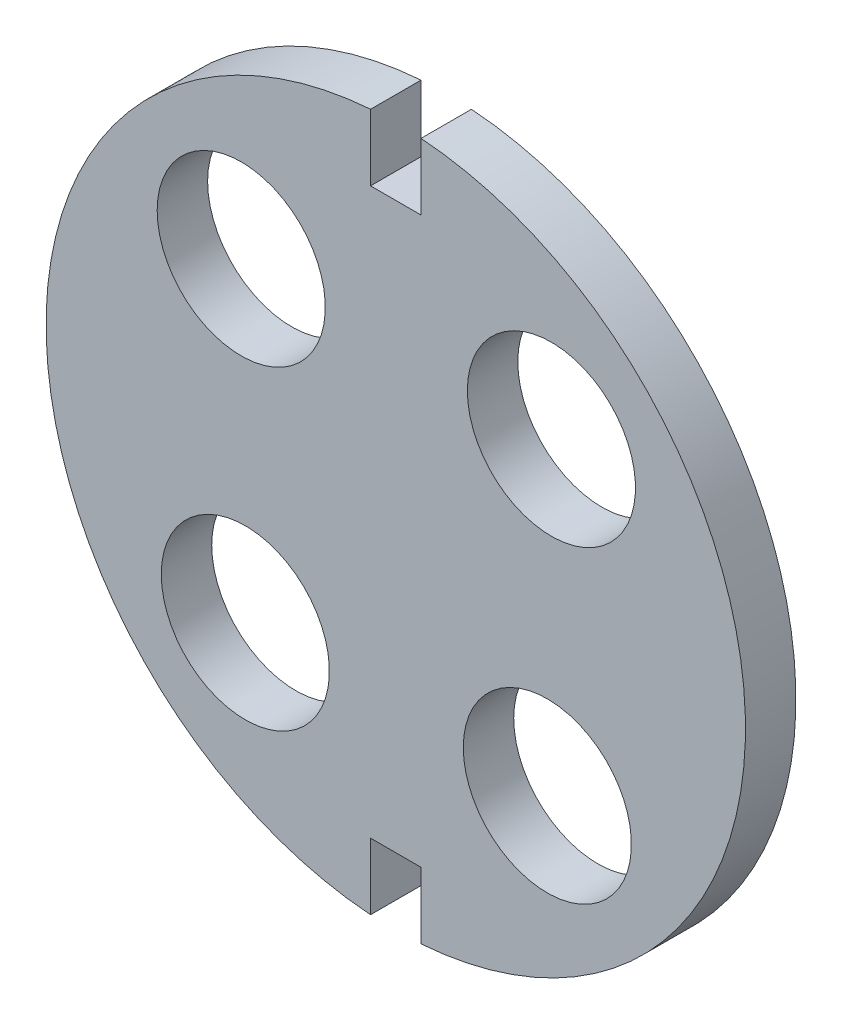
ISO-10303-21;
HEADER;
FILE_DESCRIPTION(('STEP AP214'),'2;1');
FILE_NAME('part.step','',(''),(''),'','','');
FILE_SCHEMA(('AUTOMOTIVE_DESIGN { 1 0 10303 214 1 1 1 1 }'));
ENDSEC;
DATA;
#1=APPLICATION_CONTEXT('core data for automotive mechanical design processes');
#2=APPLICATION_PROTOCOL_DEFINITION('international standard','automotive_design',2000,#1);
#3=PRODUCT_CONTEXT('',#1,'mechanical');
#4=PRODUCT('Part','Part','',(#3));
#5=PRODUCT_RELATED_PRODUCT_CATEGORY('part','',(#4));
#6=PRODUCT_DEFINITION_FORMATION('','',#4);
#7=PRODUCT_DEFINITION_CONTEXT('part definition',#1,'design');
#8=PRODUCT_DEFINITION('design','',#6,#7);
#9=PRODUCT_DEFINITION_SHAPE('','',#8);
#10=(LENGTH_UNIT() NAMED_UNIT(*) SI_UNIT(.MILLI.,.METRE.));
#11=(NAMED_UNIT(*) PLANE_ANGLE_UNIT() SI_UNIT($,.RADIAN.));
#12=(NAMED_UNIT(*) SI_UNIT($,.STERADIAN.) SOLID_ANGLE_UNIT());
#13=UNCERTAINTY_MEASURE_WITH_UNIT(LENGTH_MEASURE(1.E-05),#10,'distance_accuracy_value','');
#14=(GEOMETRIC_REPRESENTATION_CONTEXT(3) GLOBAL_UNCERTAINTY_ASSIGNED_CONTEXT((#13)) GLOBAL_UNIT_ASSIGNED_CONTEXT((#10,
#11,#12)) REPRESENTATION_CONTEXT('',''));
#15=CARTESIAN_POINT('',(0.,0.,0.));
#16=DIRECTION('',(0.,0.,1.));
#17=DIRECTION('',(1.,0.,0.));
#18=AXIS2_PLACEMENT_3D('',#15,#16,#17);
#19=CARTESIAN_POINT('',(0.,0.,3.81));
#20=DIRECTION('',(0.,0.,1.));
#21=DIRECTION('',(1.,0.,0.));
#22=AXIS2_PLACEMENT_3D('',#19,#20,#21);
#23=PLANE('',#22);
#24=CARTESIAN_POINT('',(11.4489030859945,-11.8954915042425,3.81));
#25=DIRECTION('',(0.,0.,1.));
#26=DIRECTION('',(1.,0.,0.));
#27=AXIS2_PLACEMENT_3D('',#24,#25,#26);
#28=CIRCLE('',#27,6.35);
#29=CARTESIAN_POINT('',(5.09890308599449,-11.8954915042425,3.81));
#30=VERTEX_POINT('',#29);
#31=EDGE_CURVE('E156',#30,#30,#28,.T.);
#32=ORIENTED_EDGE('',*,*,#31,.F.);
#33=EDGE_LOOP('',(#32));
#34=FACE_BOUND('',#33,.T.);
#35=CARTESIAN_POINT('',(-11.6743329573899,11.6743329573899,3.81));
#36=DIRECTION('',(0.,0.,1.));
#37=DIRECTION('',(1.,0.,0.));
#38=AXIS2_PLACEMENT_3D('',#35,#36,#37);
#39=CIRCLE('',#38,6.35);
#40=CARTESIAN_POINT('',(-18.0243329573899,11.6743329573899,3.81));
#41=VERTEX_POINT('',#40);
#42=EDGE_CURVE('E168',#41,#41,#39,.T.);
#43=ORIENTED_EDGE('',*,*,#42,.F.);
#44=EDGE_LOOP('',(#43));
#45=FACE_BOUND('',#44,.T.);
#46=CARTESIAN_POINT('',(11.7568886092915,11.5911893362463,3.81));
#47=DIRECTION('',(0.,0.,1.));
#48=DIRECTION('',(1.,0.,0.));
#49=AXIS2_PLACEMENT_3D('',#46,#47,#48);
#50=CIRCLE('',#49,6.35);
#51=CARTESIAN_POINT('',(5.40688860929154,11.5911893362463,3.81));
#52=VERTEX_POINT('',#51);
#53=EDGE_CURVE('E162',#52,#52,#50,.T.);
#54=ORIENTED_EDGE('',*,*,#53,.F.);
#55=EDGE_LOOP('',(#54));
#56=FACE_BOUND('',#55,.T.);
#57=CARTESIAN_POINT('',(-11.3642808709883,-11.9763608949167,3.81));
#58=DIRECTION('',(0.,0.,1.));
#59=DIRECTION('',(1.,0.,0.));
#60=AXIS2_PLACEMENT_3D('',#57,#58,#59);
#61=CIRCLE('',#60,6.35);
#62=CARTESIAN_POINT('',(-17.7142808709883,-11.9763608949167,3.81));
#63=VERTEX_POINT('',#62);
#64=EDGE_CURVE('E150',#63,#63,#61,.T.);
#65=ORIENTED_EDGE('',*,*,#64,.F.);
#66=EDGE_LOOP('',(#65));
#67=FACE_BOUND('',#66,.T.);
#68=DIRECTION('',(-1.,0.,0.));
#69=VECTOR('',#68,1.);
#70=CARTESIAN_POINT('',(1.905,-21.336,3.81));
#71=LINE('',#70,#69);
#72=CARTESIAN_POINT('',(1.905,-21.336,3.81));
#73=VERTEX_POINT('',#72);
#74=CARTESIAN_POINT('',(-1.905,-21.336,3.81));
#75=VERTEX_POINT('',#74);
#76=EDGE_CURVE('E125',#73,#75,#71,.T.);
#77=ORIENTED_EDGE('',*,*,#76,.F.);
#78=DIRECTION('',(0.,1.,0.));
#79=VECTOR('',#78,1.);
#80=CARTESIAN_POINT('',(1.905,-27.9234461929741,3.81));
#81=LINE('',#80,#79);
#82=CARTESIAN_POINT('',(1.905,-26.3472205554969,3.81));
#83=VERTEX_POINT('',#82);
#84=EDGE_CURVE('E114',#83,#73,#81,.T.);
#85=ORIENTED_EDGE('',*,*,#84,.F.);
#86=CARTESIAN_POINT('',(0.,0.,3.81));
#87=DIRECTION('',(0.,0.,1.));
#88=DIRECTION('',(1.,0.,0.));
#89=AXIS2_PLACEMENT_3D('',#86,#87,#88);
#90=CIRCLE('',#89,26.416);
#91=CARTESIAN_POINT('',(1.905,26.3472205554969,3.81));
#92=VERTEX_POINT('',#91);
#93=EDGE_CURVE('E54',#83,#92,#90,.T.);
#94=ORIENTED_EDGE('',*,*,#93,.T.);
#95=DIRECTION('',(0.,1.,0.));
#96=VECTOR('',#95,1.);
#97=CARTESIAN_POINT('',(1.905,27.419564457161,3.81));
#98=LINE('',#97,#96);
#99=CARTESIAN_POINT('',(1.905,21.336,3.81));
#100=VERTEX_POINT('',#99);
#101=EDGE_CURVE('E140',#100,#92,#98,.T.);
#102=ORIENTED_EDGE('',*,*,#101,.F.);
#103=DIRECTION('',(1.,0.,0.));
#104=VECTOR('',#103,1.);
#105=CARTESIAN_POINT('',(-1.905,21.336,3.81));
#106=LINE('',#105,#104);
#107=CARTESIAN_POINT('',(-1.905,21.336,3.81));
#108=VERTEX_POINT('',#107);
#109=EDGE_CURVE('E138',#108,#100,#106,.T.);
#110=ORIENTED_EDGE('',*,*,#109,.F.);
#111=DIRECTION('',(0.,-1.,0.));
#112=VECTOR('',#111,1.);
#113=CARTESIAN_POINT('',(-1.905,27.419564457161,3.81));
#114=LINE('',#113,#112);
#115=CARTESIAN_POINT('',(-1.905,26.3472205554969,3.81));
#116=VERTEX_POINT('',#115);
#117=EDGE_CURVE('E136',#116,#108,#114,.T.);
#118=ORIENTED_EDGE('',*,*,#117,.F.);
#119=CARTESIAN_POINT('',(-1.905,-26.3472205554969,3.81));
#120=VERTEX_POINT('',#119);
#121=EDGE_CURVE('E174',#116,#120,#90,.T.);
#122=ORIENTED_EDGE('',*,*,#121,.T.);
#123=DIRECTION('',(0.,-1.,0.));
#124=VECTOR('',#123,1.);
#125=CARTESIAN_POINT('',(-1.905,-27.9234461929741,3.81));
#126=LINE('',#125,#124);
#127=EDGE_CURVE('E46',#75,#120,#126,.T.);
#128=ORIENTED_EDGE('',*,*,#127,.F.);
#129=EDGE_LOOP('',(#77,#85,#94,#102,#110,#118,#122,#128));
#130=FACE_BOUND('',#129,.T.);
#131=ADVANCED_FACE('F31',(#34,#45,#56,#67,#130),#23,.T.);
#132=CARTESIAN_POINT('',(0.,0.,0.));
#133=DIRECTION('',(0.,0.,1.));
#134=DIRECTION('',(1.,0.,0.));
#135=AXIS2_PLACEMENT_3D('',#132,#133,#134);
#136=PLANE('',#135);
#137=CARTESIAN_POINT('',(11.4489030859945,-11.8954915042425,0.));
#138=DIRECTION('',(0.,0.,1.));
#139=DIRECTION('',(1.,0.,0.));
#140=AXIS2_PLACEMENT_3D('',#137,#138,#139);
#141=CIRCLE('',#140,6.35);
#142=CARTESIAN_POINT('',(5.09890308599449,-11.8954915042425,0.));
#143=VERTEX_POINT('',#142);
#144=EDGE_CURVE('E153',#143,#143,#141,.T.);
#145=ORIENTED_EDGE('',*,*,#144,.T.);
#146=EDGE_LOOP('',(#145));
#147=FACE_BOUND('',#146,.T.);
#148=CARTESIAN_POINT('',(-11.6743329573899,11.6743329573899,0.));
#149=DIRECTION('',(0.,0.,1.));
#150=DIRECTION('',(1.,0.,0.));
#151=AXIS2_PLACEMENT_3D('',#148,#149,#150);
#152=CIRCLE('',#151,6.35);
#153=CARTESIAN_POINT('',(-18.0243329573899,11.6743329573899,0.));
#154=VERTEX_POINT('',#153);
#155=EDGE_CURVE('E165',#154,#154,#152,.T.);
#156=ORIENTED_EDGE('',*,*,#155,.T.);
#157=EDGE_LOOP('',(#156));
#158=FACE_BOUND('',#157,.T.);
#159=CARTESIAN_POINT('',(11.7568886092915,11.5911893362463,0.));
#160=DIRECTION('',(0.,0.,1.));
#161=DIRECTION('',(1.,0.,0.));
#162=AXIS2_PLACEMENT_3D('',#159,#160,#161);
#163=CIRCLE('',#162,6.35);
#164=CARTESIAN_POINT('',(5.40688860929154,11.5911893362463,0.));
#165=VERTEX_POINT('',#164);
#166=EDGE_CURVE('E159',#165,#165,#163,.T.);
#167=ORIENTED_EDGE('',*,*,#166,.T.);
#168=EDGE_LOOP('',(#167));
#169=FACE_BOUND('',#168,.T.);
#170=CARTESIAN_POINT('',(-11.3642808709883,-11.9763608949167,0.));
#171=DIRECTION('',(0.,0.,1.));
#172=DIRECTION('',(1.,0.,0.));
#173=AXIS2_PLACEMENT_3D('',#170,#171,#172);
#174=CIRCLE('',#173,6.35);
#175=CARTESIAN_POINT('',(-17.7142808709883,-11.9763608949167,0.));
#176=VERTEX_POINT('',#175);
#177=EDGE_CURVE('E147',#176,#176,#174,.T.);
#178=ORIENTED_EDGE('',*,*,#177,.T.);
#179=EDGE_LOOP('',(#178));
#180=FACE_BOUND('',#179,.T.);
#181=DIRECTION('',(0.,1.,0.));
#182=VECTOR('',#181,1.);
#183=CARTESIAN_POINT('',(1.905,-27.9234461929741,0.));
#184=LINE('',#183,#182);
#185=CARTESIAN_POINT('',(1.905,-26.3472205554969,0.));
#186=VERTEX_POINT('',#185);
#187=CARTESIAN_POINT('',(1.905,-21.336,0.));
#188=VERTEX_POINT('',#187);
#189=EDGE_CURVE('E109',#186,#188,#184,.T.);
#190=ORIENTED_EDGE('',*,*,#189,.T.);
#191=DIRECTION('',(-1.,0.,0.));
#192=VECTOR('',#191,1.);
#193=CARTESIAN_POINT('',(1.905,-21.336,0.));
#194=LINE('',#193,#192);
#195=CARTESIAN_POINT('',(-1.905,-21.336,0.));
#196=VERTEX_POINT('',#195);
#197=EDGE_CURVE('E98',#188,#196,#194,.T.);
#198=ORIENTED_EDGE('',*,*,#197,.T.);
#199=DIRECTION('',(0.,-1.,0.));
#200=VECTOR('',#199,1.);
#201=CARTESIAN_POINT('',(-1.905,-27.9234461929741,0.));
#202=LINE('',#201,#200);
#203=CARTESIAN_POINT('',(-1.905,-26.3472205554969,0.));
#204=VERTEX_POINT('',#203);
#205=EDGE_CURVE('E108',#196,#204,#202,.T.);
#206=ORIENTED_EDGE('',*,*,#205,.T.);
#207=CARTESIAN_POINT('',(0.,0.,0.));
#208=DIRECTION('',(0.,0.,1.));
#209=DIRECTION('',(1.,0.,0.));
#210=AXIS2_PLACEMENT_3D('',#207,#208,#209);
#211=CIRCLE('',#210,26.416);
#212=CARTESIAN_POINT('',(-1.905,26.3472205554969,0.));
#213=VERTEX_POINT('',#212);
#214=EDGE_CURVE('E171',#213,#204,#211,.T.);
#215=ORIENTED_EDGE('',*,*,#214,.F.);
#216=DIRECTION('',(0.,-1.,0.));
#217=VECTOR('',#216,1.);
#218=CARTESIAN_POINT('',(-1.905,27.419564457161,0.));
#219=LINE('',#218,#217);
#220=CARTESIAN_POINT('',(-1.905,21.336,0.));
#221=VERTEX_POINT('',#220);
#222=EDGE_CURVE('E115',#213,#221,#219,.T.);
#223=ORIENTED_EDGE('',*,*,#222,.T.);
#224=DIRECTION('',(1.,0.,0.));
#225=VECTOR('',#224,1.);
#226=CARTESIAN_POINT('',(-1.905,21.336,0.));
#227=LINE('',#226,#225);
#228=CARTESIAN_POINT('',(1.905,21.336,0.));
#229=VERTEX_POINT('',#228);
#230=EDGE_CURVE('E131',#221,#229,#227,.T.);
#231=ORIENTED_EDGE('',*,*,#230,.T.);
#232=DIRECTION('',(0.,1.,0.));
#233=VECTOR('',#232,1.);
#234=CARTESIAN_POINT('',(1.905,27.419564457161,0.));
#235=LINE('',#234,#233);
#236=CARTESIAN_POINT('',(1.905,26.3472205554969,0.));
#237=VERTEX_POINT('',#236);
#238=EDGE_CURVE('E134',#229,#237,#235,.T.);
#239=ORIENTED_EDGE('',*,*,#238,.T.);
#240=EDGE_CURVE('E120',#186,#237,#211,.T.);
#241=ORIENTED_EDGE('',*,*,#240,.F.);
#242=EDGE_LOOP('',(#190,#198,#206,#215,#223,#231,#239,#241));
#243=FACE_BOUND('',#242,.T.);
#244=ADVANCED_FACE('F118',(#147,#158,#169,#180,#243),#136,.F.);
#245=CARTESIAN_POINT('',(0.,0.,3.81));
#246=DIRECTION('',(0.,0.,-1.));
#247=DIRECTION('',(-1.,0.,0.));
#248=AXIS2_PLACEMENT_3D('',#245,#246,#247);
#249=CYLINDRICAL_SURFACE('',#248,26.416);
#250=DIRECTION('',(0.,0.,-1.));
#251=VECTOR('',#250,1.);
#252=CARTESIAN_POINT('',(1.905,-26.3472205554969,3.81));
#253=LINE('',#252,#251);
#254=EDGE_CURVE('E11',#186,#83,#253,.F.);
#255=ORIENTED_EDGE('',*,*,#254,.F.);
#256=ORIENTED_EDGE('',*,*,#240,.T.);
#257=DIRECTION('',(0.,0.,-1.));
#258=VECTOR('',#257,1.);
#259=CARTESIAN_POINT('',(1.905,26.3472205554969,3.81));
#260=LINE('',#259,#258);
#261=EDGE_CURVE('E177',#92,#237,#260,.T.);
#262=ORIENTED_EDGE('',*,*,#261,.F.);
#263=ORIENTED_EDGE('',*,*,#93,.F.);
#264=EDGE_LOOP('',(#255,#256,#262,#263));
#265=FACE_BOUND('',#264,.T.);
#266=ADVANCED_FACE('F33',(#265),#249,.T.);
#267=DIRECTION('',(0.,0.,-1.));
#268=VECTOR('',#267,1.);
#269=CARTESIAN_POINT('',(-1.905,-26.3472205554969,3.81));
#270=LINE('',#269,#268);
#271=EDGE_CURVE('E39',#120,#204,#270,.T.);
#272=ORIENTED_EDGE('',*,*,#271,.F.);
#273=ORIENTED_EDGE('',*,*,#121,.F.);
#274=DIRECTION('',(0.,0.,-1.));
#275=VECTOR('',#274,1.);
#276=CARTESIAN_POINT('',(-1.905,26.3472205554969,3.81));
#277=LINE('',#276,#275);
#278=EDGE_CURVE('E180',#213,#116,#277,.F.);
#279=ORIENTED_EDGE('',*,*,#278,.F.);
#280=ORIENTED_EDGE('',*,*,#214,.T.);
#281=EDGE_LOOP('',(#272,#273,#279,#280));
#282=FACE_BOUND('',#281,.T.);
#283=ADVANCED_FACE('F186',(#282),#249,.T.);
#284=CARTESIAN_POINT('',(-11.6743329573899,11.6743329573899,3.81));
#285=DIRECTION('',(0.,0.,-1.));
#286=DIRECTION('',(-1.,0.,0.));
#287=AXIS2_PLACEMENT_3D('',#284,#285,#286);
#288=CYLINDRICAL_SURFACE('',#287,6.35);
#289=CARTESIAN_POINT('',(-18.0243329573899,11.6743329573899,3.81));
#290=CARTESIAN_POINT('',(-18.0243329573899,11.6743329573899,3.7703125));
#291=CARTESIAN_POINT('',(-18.0243329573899,11.6743329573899,3.730625));
#292=CARTESIAN_POINT('',(-18.0243329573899,11.6743329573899,3.65125));
#293=CARTESIAN_POINT('',(-18.0243329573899,11.6743329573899,3.6115625));
#294=CARTESIAN_POINT('',(-18.0243329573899,11.6743329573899,3.5321875));
#295=CARTESIAN_POINT('',(-18.0243329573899,11.6743329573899,3.4925));
#296=CARTESIAN_POINT('',(-18.0243329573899,11.6743329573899,3.413125));
#297=CARTESIAN_POINT('',(-18.0243329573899,11.6743329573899,3.3734375));
#298=CARTESIAN_POINT('',(-18.0243329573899,11.6743329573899,3.2940625));
#299=CARTESIAN_POINT('',(-18.0243329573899,11.6743329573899,3.254375));
#300=CARTESIAN_POINT('',(-18.0243329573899,11.6743329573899,3.175));
#301=CARTESIAN_POINT('',(-18.0243329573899,11.6743329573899,3.1353125));
#302=CARTESIAN_POINT('',(-18.0243329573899,11.6743329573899,3.0559375));
#303=CARTESIAN_POINT('',(-18.0243329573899,11.6743329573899,3.01625));
#304=CARTESIAN_POINT('',(-18.0243329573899,11.6743329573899,2.936875));
#305=CARTESIAN_POINT('',(-18.0243329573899,11.6743329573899,2.8971875));
#306=CARTESIAN_POINT('',(-18.0243329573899,11.6743329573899,2.8178125));
#307=CARTESIAN_POINT('',(-18.0243329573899,11.6743329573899,2.778125));
#308=CARTESIAN_POINT('',(-18.0243329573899,11.6743329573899,2.69875));
#309=CARTESIAN_POINT('',(-18.0243329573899,11.6743329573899,2.6590625));
#310=CARTESIAN_POINT('',(-18.0243329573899,11.6743329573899,2.5796875));
#311=CARTESIAN_POINT('',(-18.0243329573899,11.6743329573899,2.54));
#312=CARTESIAN_POINT('',(-18.0243329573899,11.6743329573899,2.460625));
#313=CARTESIAN_POINT('',(-18.0243329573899,11.6743329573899,2.4209375));
#314=CARTESIAN_POINT('',(-18.0243329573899,11.6743329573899,2.3415625));
#315=CARTESIAN_POINT('',(-18.0243329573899,11.6743329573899,2.301875));
#316=CARTESIAN_POINT('',(-18.0243329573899,11.6743329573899,2.2225));
#317=CARTESIAN_POINT('',(-18.0243329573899,11.6743329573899,2.1828125));
#318=CARTESIAN_POINT('',(-18.0243329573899,11.6743329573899,2.1034375));
#319=CARTESIAN_POINT('',(-18.0243329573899,11.6743329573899,2.06375));
#320=CARTESIAN_POINT('',(-18.0243329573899,11.6743329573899,1.984375));
#321=CARTESIAN_POINT('',(-18.0243329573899,11.6743329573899,1.9446875));
#322=CARTESIAN_POINT('',(-18.0243329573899,11.6743329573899,1.8653125));
#323=CARTESIAN_POINT('',(-18.0243329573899,11.6743329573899,1.825625));
#324=CARTESIAN_POINT('',(-18.0243329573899,11.6743329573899,1.74625));
#325=CARTESIAN_POINT('',(-18.0243329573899,11.6743329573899,1.7065625));
#326=CARTESIAN_POINT('',(-18.0243329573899,11.6743329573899,1.6271875));
#327=CARTESIAN_POINT('',(-18.0243329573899,11.6743329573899,1.5875));
#328=CARTESIAN_POINT('',(-18.0243329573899,11.6743329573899,1.508125));
#329=CARTESIAN_POINT('',(-18.0243329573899,11.6743329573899,1.4684375));
#330=CARTESIAN_POINT('',(-18.0243329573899,11.6743329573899,1.3890625));
#331=CARTESIAN_POINT('',(-18.0243329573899,11.6743329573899,1.349375));
#332=CARTESIAN_POINT('',(-18.0243329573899,11.6743329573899,1.27));
#333=CARTESIAN_POINT('',(-18.0243329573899,11.6743329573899,1.2303125));
#334=CARTESIAN_POINT('',(-18.0243329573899,11.6743329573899,1.1509375));
#335=CARTESIAN_POINT('',(-18.0243329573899,11.6743329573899,1.11125));
#336=CARTESIAN_POINT('',(-18.0243329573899,11.6743329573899,1.031875));
#337=CARTESIAN_POINT('',(-18.0243329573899,11.6743329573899,0.9921875));
#338=CARTESIAN_POINT('',(-18.0243329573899,11.6743329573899,0.9128125));
#339=CARTESIAN_POINT('',(-18.0243329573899,11.6743329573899,0.873125));
#340=CARTESIAN_POINT('',(-18.0243329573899,11.6743329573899,0.79375));
#341=CARTESIAN_POINT('',(-18.0243329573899,11.6743329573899,0.7540625));
#342=CARTESIAN_POINT('',(-18.0243329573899,11.6743329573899,0.6746875));
#343=CARTESIAN_POINT('',(-18.0243329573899,11.6743329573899,0.635));
#344=CARTESIAN_POINT('',(-18.0243329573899,11.6743329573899,0.555625));
#345=CARTESIAN_POINT('',(-18.0243329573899,11.6743329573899,0.5159375));
#346=CARTESIAN_POINT('',(-18.0243329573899,11.6743329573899,0.4365625));
#347=CARTESIAN_POINT('',(-18.0243329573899,11.6743329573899,0.396875));
#348=CARTESIAN_POINT('',(-18.0243329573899,11.6743329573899,0.3175));
#349=CARTESIAN_POINT('',(-18.0243329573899,11.6743329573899,0.2778125));
#350=CARTESIAN_POINT('',(-18.0243329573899,11.6743329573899,0.1984375));
#351=CARTESIAN_POINT('',(-18.0243329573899,11.6743329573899,0.15875));
#352=CARTESIAN_POINT('',(-18.0243329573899,11.6743329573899,0.0793749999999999));
#353=CARTESIAN_POINT('',(-18.0243329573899,11.6743329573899,0.0396874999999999));
#354=CARTESIAN_POINT('',(-18.0243329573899,11.6743329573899,0.));
#355=B_SPLINE_CURVE_WITH_KNOTS('',3,(#289,#290,#291,#292,#293,#294,#295,#296,#297,#298,#299,
#300,#301,#302,#303,#304,#305,#306,#307,#308,#309,#310,#311,#312,#313,#314,#315,#316,#317,#318,
#319,#320,#321,#322,#323,#324,#325,#326,#327,#328,#329,#330,#331,#332,#333,#334,#335,#336,#337,
#338,#339,#340,#341,#342,#343,#344,#345,#346,#347,#348,#349,#350,#351,#352,#353,#354),
.UNSPECIFIED.,.F.,.F.,(4,2,2,2,2,2,2,2,2,2,2,2,2,2,2,2,2,2,2,2,2,2,2,2,2,2,2,2,2,2,2,2,4),(0.,
0.1190625,0.238125,0.3571875,0.47625,0.5953125,0.714375,0.8334375,0.9525,1.0715625,1.190625,
1.3096875,1.42875,1.5478125,1.666875,1.7859375,1.905,2.0240625,2.143125,2.2621875,2.38125,
2.5003125,2.619375,2.7384375,2.8575,2.9765625,3.095625,3.2146875,3.33375,3.4528125,3.571875,
3.6909375,3.81),.UNSPECIFIED.);
#356=EDGE_CURVE('BSEAM205',#41,#154,#355,.T.);
#357=ORIENTED_EDGE('',*,*,#42,.T.);
#358=ORIENTED_EDGE('',*,*,#155,.F.);
#359=ORIENTED_EDGE('',*,*,#356,.T.);
#360=ORIENTED_EDGE('',*,*,#356,.F.);
#361=EDGE_LOOP('',(#357,#359,#358,#360));
#362=FACE_BOUND('',#361,.T.);
#363=ADVANCED_FACE('F205',(#362),#288,.F.);
#364=CARTESIAN_POINT('',(11.7568886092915,11.5911893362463,3.81));
#365=DIRECTION('',(0.,0.,-1.));
#366=DIRECTION('',(-1.,0.,0.));
#367=AXIS2_PLACEMENT_3D('',#364,#365,#366);
#368=CYLINDRICAL_SURFACE('',#367,6.35);
#369=CARTESIAN_POINT('',(5.40688860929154,11.5911893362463,3.81));
#370=CARTESIAN_POINT('',(5.40688860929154,11.5911893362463,3.7703125));
#371=CARTESIAN_POINT('',(5.40688860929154,11.5911893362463,3.730625));
#372=CARTESIAN_POINT('',(5.40688860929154,11.5911893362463,3.65125));
#373=CARTESIAN_POINT('',(5.40688860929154,11.5911893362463,3.6115625));
#374=CARTESIAN_POINT('',(5.40688860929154,11.5911893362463,3.5321875));
#375=CARTESIAN_POINT('',(5.40688860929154,11.5911893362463,3.4925));
#376=CARTESIAN_POINT('',(5.40688860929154,11.5911893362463,3.413125));
#377=CARTESIAN_POINT('',(5.40688860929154,11.5911893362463,3.3734375));
#378=CARTESIAN_POINT('',(5.40688860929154,11.5911893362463,3.2940625));
#379=CARTESIAN_POINT('',(5.40688860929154,11.5911893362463,3.254375));
#380=CARTESIAN_POINT('',(5.40688860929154,11.5911893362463,3.175));
#381=CARTESIAN_POINT('',(5.40688860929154,11.5911893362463,3.1353125));
#382=CARTESIAN_POINT('',(5.40688860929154,11.5911893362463,3.0559375));
#383=CARTESIAN_POINT('',(5.40688860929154,11.5911893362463,3.01625));
#384=CARTESIAN_POINT('',(5.40688860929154,11.5911893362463,2.936875));
#385=CARTESIAN_POINT('',(5.40688860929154,11.5911893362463,2.8971875));
#386=CARTESIAN_POINT('',(5.40688860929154,11.5911893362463,2.8178125));
#387=CARTESIAN_POINT('',(5.40688860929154,11.5911893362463,2.778125));
#388=CARTESIAN_POINT('',(5.40688860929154,11.5911893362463,2.69875));
#389=CARTESIAN_POINT('',(5.40688860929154,11.5911893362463,2.6590625));
#390=CARTESIAN_POINT('',(5.40688860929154,11.5911893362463,2.5796875));
#391=CARTESIAN_POINT('',(5.40688860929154,11.5911893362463,2.54));
#392=CARTESIAN_POINT('',(5.40688860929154,11.5911893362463,2.460625));
#393=CARTESIAN_POINT('',(5.40688860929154,11.5911893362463,2.4209375));
#394=CARTESIAN_POINT('',(5.40688860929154,11.5911893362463,2.3415625));
#395=CARTESIAN_POINT('',(5.40688860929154,11.5911893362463,2.301875));
#396=CARTESIAN_POINT('',(5.40688860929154,11.5911893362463,2.2225));
#397=CARTESIAN_POINT('',(5.40688860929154,11.5911893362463,2.1828125));
#398=CARTESIAN_POINT('',(5.40688860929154,11.5911893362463,2.1034375));
#399=CARTESIAN_POINT('',(5.40688860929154,11.5911893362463,2.06375));
#400=CARTESIAN_POINT('',(5.40688860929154,11.5911893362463,1.984375));
#401=CARTESIAN_POINT('',(5.40688860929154,11.5911893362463,1.9446875));
#402=CARTESIAN_POINT('',(5.40688860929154,11.5911893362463,1.8653125));
#403=CARTESIAN_POINT('',(5.40688860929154,11.5911893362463,1.825625));
#404=CARTESIAN_POINT('',(5.40688860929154,11.5911893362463,1.74625));
#405=CARTESIAN_POINT('',(5.40688860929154,11.5911893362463,1.7065625));
#406=CARTESIAN_POINT('',(5.40688860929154,11.5911893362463,1.6271875));
#407=CARTESIAN_POINT('',(5.40688860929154,11.5911893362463,1.5875));
#408=CARTESIAN_POINT('',(5.40688860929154,11.5911893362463,1.508125));
#409=CARTESIAN_POINT('',(5.40688860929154,11.5911893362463,1.4684375));
#410=CARTESIAN_POINT('',(5.40688860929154,11.5911893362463,1.3890625));
#411=CARTESIAN_POINT('',(5.40688860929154,11.5911893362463,1.349375));
#412=CARTESIAN_POINT('',(5.40688860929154,11.5911893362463,1.27));
#413=CARTESIAN_POINT('',(5.40688860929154,11.5911893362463,1.2303125));
#414=CARTESIAN_POINT('',(5.40688860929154,11.5911893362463,1.1509375));
#415=CARTESIAN_POINT('',(5.40688860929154,11.5911893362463,1.11125));
#416=CARTESIAN_POINT('',(5.40688860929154,11.5911893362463,1.031875));
#417=CARTESIAN_POINT('',(5.40688860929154,11.5911893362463,0.9921875));
#418=CARTESIAN_POINT('',(5.40688860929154,11.5911893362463,0.9128125));
#419=CARTESIAN_POINT('',(5.40688860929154,11.5911893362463,0.873125));
#420=CARTESIAN_POINT('',(5.40688860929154,11.5911893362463,0.79375));
#421=CARTESIAN_POINT('',(5.40688860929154,11.5911893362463,0.7540625));
#422=CARTESIAN_POINT('',(5.40688860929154,11.5911893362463,0.6746875));
#423=CARTESIAN_POINT('',(5.40688860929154,11.5911893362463,0.635));
#424=CARTESIAN_POINT('',(5.40688860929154,11.5911893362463,0.555625));
#425=CARTESIAN_POINT('',(5.40688860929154,11.5911893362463,0.5159375));
#426=CARTESIAN_POINT('',(5.40688860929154,11.5911893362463,0.4365625));
#427=CARTESIAN_POINT('',(5.40688860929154,11.5911893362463,0.396875));
#428=CARTESIAN_POINT('',(5.40688860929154,11.5911893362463,0.3175));
#429=CARTESIAN_POINT('',(5.40688860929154,11.5911893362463,0.2778125));
#430=CARTESIAN_POINT('',(5.40688860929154,11.5911893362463,0.1984375));
#431=CARTESIAN_POINT('',(5.40688860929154,11.5911893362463,0.15875));
#432=CARTESIAN_POINT('',(5.40688860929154,11.5911893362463,0.0793749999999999));
#433=CARTESIAN_POINT('',(5.40688860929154,11.5911893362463,0.0396874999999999));
#434=CARTESIAN_POINT('',(5.40688860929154,11.5911893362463,0.));
#435=B_SPLINE_CURVE_WITH_KNOTS('',3,(#369,#370,#371,#372,#373,#374,#375,#376,#377,#378,#379,
#380,#381,#382,#383,#384,#385,#386,#387,#388,#389,#390,#391,#392,#393,#394,#395,#396,#397,#398,
#399,#400,#401,#402,#403,#404,#405,#406,#407,#408,#409,#410,#411,#412,#413,#414,#415,#416,#417,
#418,#419,#420,#421,#422,#423,#424,#425,#426,#427,#428,#429,#430,#431,#432,#433,#434),
.UNSPECIFIED.,.F.,.F.,(4,2,2,2,2,2,2,2,2,2,2,2,2,2,2,2,2,2,2,2,2,2,2,2,2,2,2,2,2,2,2,2,4),(0.,
0.1190625,0.238125,0.3571875,0.47625,0.5953125,0.714375,0.8334375,0.9525,1.0715625,1.190625,
1.3096875,1.42875,1.5478125,1.666875,1.7859375,1.905,2.0240625,2.143125,2.2621875,2.38125,
2.5003125,2.619375,2.7384375,2.8575,2.9765625,3.095625,3.2146875,3.33375,3.4528125,3.571875,
3.6909375,3.81),.UNSPECIFIED.);
#436=EDGE_CURVE('BSEAM217',#52,#165,#435,.T.);
#437=ORIENTED_EDGE('',*,*,#53,.T.);
#438=ORIENTED_EDGE('',*,*,#166,.F.);
#439=ORIENTED_EDGE('',*,*,#436,.T.);
#440=ORIENTED_EDGE('',*,*,#436,.F.);
#441=EDGE_LOOP('',(#437,#439,#438,#440));
#442=FACE_BOUND('',#441,.T.);
#443=ADVANCED_FACE('F217',(#442),#368,.F.);
#444=CARTESIAN_POINT('',(11.4489030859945,-11.8954915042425,3.81));
#445=DIRECTION('',(0.,0.,-1.));
#446=DIRECTION('',(-1.,0.,0.));
#447=AXIS2_PLACEMENT_3D('',#444,#445,#446);
#448=CYLINDRICAL_SURFACE('',#447,6.35);
#449=CARTESIAN_POINT('',(5.09890308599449,-11.8954915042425,3.81));
#450=CARTESIAN_POINT('',(5.09890308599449,-11.8954915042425,3.7703125));
#451=CARTESIAN_POINT('',(5.09890308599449,-11.8954915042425,3.730625));
#452=CARTESIAN_POINT('',(5.09890308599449,-11.8954915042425,3.65125));
#453=CARTESIAN_POINT('',(5.09890308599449,-11.8954915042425,3.6115625));
#454=CARTESIAN_POINT('',(5.09890308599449,-11.8954915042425,3.5321875));
#455=CARTESIAN_POINT('',(5.09890308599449,-11.8954915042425,3.4925));
#456=CARTESIAN_POINT('',(5.09890308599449,-11.8954915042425,3.413125));
#457=CARTESIAN_POINT('',(5.09890308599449,-11.8954915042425,3.3734375));
#458=CARTESIAN_POINT('',(5.09890308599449,-11.8954915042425,3.2940625));
#459=CARTESIAN_POINT('',(5.09890308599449,-11.8954915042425,3.254375));
#460=CARTESIAN_POINT('',(5.09890308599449,-11.8954915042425,3.175));
#461=CARTESIAN_POINT('',(5.09890308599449,-11.8954915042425,3.1353125));
#462=CARTESIAN_POINT('',(5.09890308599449,-11.8954915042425,3.0559375));
#463=CARTESIAN_POINT('',(5.09890308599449,-11.8954915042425,3.01625));
#464=CARTESIAN_POINT('',(5.09890308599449,-11.8954915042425,2.936875));
#465=CARTESIAN_POINT('',(5.09890308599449,-11.8954915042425,2.8971875));
#466=CARTESIAN_POINT('',(5.09890308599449,-11.8954915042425,2.8178125));
#467=CARTESIAN_POINT('',(5.09890308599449,-11.8954915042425,2.778125));
#468=CARTESIAN_POINT('',(5.09890308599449,-11.8954915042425,2.69875));
#469=CARTESIAN_POINT('',(5.09890308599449,-11.8954915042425,2.6590625));
#470=CARTESIAN_POINT('',(5.09890308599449,-11.8954915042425,2.5796875));
#471=CARTESIAN_POINT('',(5.09890308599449,-11.8954915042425,2.54));
#472=CARTESIAN_POINT('',(5.09890308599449,-11.8954915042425,2.460625));
#473=CARTESIAN_POINT('',(5.09890308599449,-11.8954915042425,2.4209375));
#474=CARTESIAN_POINT('',(5.09890308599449,-11.8954915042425,2.3415625));
#475=CARTESIAN_POINT('',(5.09890308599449,-11.8954915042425,2.301875));
#476=CARTESIAN_POINT('',(5.09890308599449,-11.8954915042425,2.2225));
#477=CARTESIAN_POINT('',(5.09890308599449,-11.8954915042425,2.1828125));
#478=CARTESIAN_POINT('',(5.09890308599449,-11.8954915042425,2.1034375));
#479=CARTESIAN_POINT('',(5.09890308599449,-11.8954915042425,2.06375));
#480=CARTESIAN_POINT('',(5.09890308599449,-11.8954915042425,1.984375));
#481=CARTESIAN_POINT('',(5.09890308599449,-11.8954915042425,1.9446875));
#482=CARTESIAN_POINT('',(5.09890308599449,-11.8954915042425,1.8653125));
#483=CARTESIAN_POINT('',(5.09890308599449,-11.8954915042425,1.825625));
#484=CARTESIAN_POINT('',(5.09890308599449,-11.8954915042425,1.74625));
#485=CARTESIAN_POINT('',(5.09890308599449,-11.8954915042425,1.7065625));
#486=CARTESIAN_POINT('',(5.09890308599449,-11.8954915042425,1.6271875));
#487=CARTESIAN_POINT('',(5.09890308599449,-11.8954915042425,1.5875));
#488=CARTESIAN_POINT('',(5.09890308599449,-11.8954915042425,1.508125));
#489=CARTESIAN_POINT('',(5.09890308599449,-11.8954915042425,1.4684375));
#490=CARTESIAN_POINT('',(5.09890308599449,-11.8954915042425,1.3890625));
#491=CARTESIAN_POINT('',(5.09890308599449,-11.8954915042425,1.349375));
#492=CARTESIAN_POINT('',(5.09890308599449,-11.8954915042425,1.27));
#493=CARTESIAN_POINT('',(5.09890308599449,-11.8954915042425,1.2303125));
#494=CARTESIAN_POINT('',(5.09890308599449,-11.8954915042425,1.1509375));
#495=CARTESIAN_POINT('',(5.09890308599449,-11.8954915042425,1.11125));
#496=CARTESIAN_POINT('',(5.09890308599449,-11.8954915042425,1.031875));
#497=CARTESIAN_POINT('',(5.09890308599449,-11.8954915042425,0.9921875));
#498=CARTESIAN_POINT('',(5.09890308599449,-11.8954915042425,0.9128125));
#499=CARTESIAN_POINT('',(5.09890308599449,-11.8954915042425,0.873125));
#500=CARTESIAN_POINT('',(5.09890308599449,-11.8954915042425,0.79375));
#501=CARTESIAN_POINT('',(5.09890308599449,-11.8954915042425,0.7540625));
#502=CARTESIAN_POINT('',(5.09890308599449,-11.8954915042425,0.6746875));
#503=CARTESIAN_POINT('',(5.09890308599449,-11.8954915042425,0.635));
#504=CARTESIAN_POINT('',(5.09890308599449,-11.8954915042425,0.555625));
#505=CARTESIAN_POINT('',(5.09890308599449,-11.8954915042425,0.5159375));
#506=CARTESIAN_POINT('',(5.09890308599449,-11.8954915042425,0.4365625));
#507=CARTESIAN_POINT('',(5.09890308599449,-11.8954915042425,0.396875));
#508=CARTESIAN_POINT('',(5.09890308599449,-11.8954915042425,0.3175));
#509=CARTESIAN_POINT('',(5.09890308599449,-11.8954915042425,0.2778125));
#510=CARTESIAN_POINT('',(5.09890308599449,-11.8954915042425,0.1984375));
#511=CARTESIAN_POINT('',(5.09890308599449,-11.8954915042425,0.15875));
#512=CARTESIAN_POINT('',(5.09890308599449,-11.8954915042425,0.0793749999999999));
#513=CARTESIAN_POINT('',(5.09890308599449,-11.8954915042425,0.0396874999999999));
#514=CARTESIAN_POINT('',(5.09890308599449,-11.8954915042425,0.));
#515=B_SPLINE_CURVE_WITH_KNOTS('',3,(#449,#450,#451,#452,#453,#454,#455,#456,#457,#458,#459,
#460,#461,#462,#463,#464,#465,#466,#467,#468,#469,#470,#471,#472,#473,#474,#475,#476,#477,#478,
#479,#480,#481,#482,#483,#484,#485,#486,#487,#488,#489,#490,#491,#492,#493,#494,#495,#496,#497,
#498,#499,#500,#501,#502,#503,#504,#505,#506,#507,#508,#509,#510,#511,#512,#513,#514),
.UNSPECIFIED.,.F.,.F.,(4,2,2,2,2,2,2,2,2,2,2,2,2,2,2,2,2,2,2,2,2,2,2,2,2,2,2,2,2,2,2,2,4),(0.,
0.1190625,0.238125,0.3571875,0.47625,0.5953125,0.714375,0.8334375,0.9525,1.0715625,1.190625,
1.3096875,1.42875,1.5478125,1.666875,1.7859375,1.905,2.0240625,2.143125,2.2621875,2.38125,
2.5003125,2.619375,2.7384375,2.8575,2.9765625,3.095625,3.2146875,3.33375,3.4528125,3.571875,
3.6909375,3.81),.UNSPECIFIED.);
#516=EDGE_CURVE('BSEAM221',#30,#143,#515,.T.);
#517=ORIENTED_EDGE('',*,*,#31,.T.);
#518=ORIENTED_EDGE('',*,*,#144,.F.);
#519=ORIENTED_EDGE('',*,*,#516,.T.);
#520=ORIENTED_EDGE('',*,*,#516,.F.);
#521=EDGE_LOOP('',(#517,#519,#518,#520));
#522=FACE_BOUND('',#521,.T.);
#523=ADVANCED_FACE('F221',(#522),#448,.F.);
#524=CARTESIAN_POINT('',(-11.3642808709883,-11.9763608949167,3.81));
#525=DIRECTION('',(0.,0.,-1.));
#526=DIRECTION('',(-1.,0.,0.));
#527=AXIS2_PLACEMENT_3D('',#524,#525,#526);
#528=CYLINDRICAL_SURFACE('',#527,6.35);
#529=CARTESIAN_POINT('',(-17.7142808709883,-11.9763608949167,3.81));
#530=CARTESIAN_POINT('',(-17.7142808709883,-11.9763608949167,3.7703125));
#531=CARTESIAN_POINT('',(-17.7142808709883,-11.9763608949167,3.730625));
#532=CARTESIAN_POINT('',(-17.7142808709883,-11.9763608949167,3.65125));
#533=CARTESIAN_POINT('',(-17.7142808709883,-11.9763608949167,3.6115625));
#534=CARTESIAN_POINT('',(-17.7142808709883,-11.9763608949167,3.5321875));
#535=CARTESIAN_POINT('',(-17.7142808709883,-11.9763608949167,3.4925));
#536=CARTESIAN_POINT('',(-17.7142808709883,-11.9763608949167,3.413125));
#537=CARTESIAN_POINT('',(-17.7142808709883,-11.9763608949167,3.3734375));
#538=CARTESIAN_POINT('',(-17.7142808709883,-11.9763608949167,3.2940625));
#539=CARTESIAN_POINT('',(-17.7142808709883,-11.9763608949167,3.254375));
#540=CARTESIAN_POINT('',(-17.7142808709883,-11.9763608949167,3.175));
#541=CARTESIAN_POINT('',(-17.7142808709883,-11.9763608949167,3.1353125));
#542=CARTESIAN_POINT('',(-17.7142808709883,-11.9763608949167,3.0559375));
#543=CARTESIAN_POINT('',(-17.7142808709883,-11.9763608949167,3.01625));
#544=CARTESIAN_POINT('',(-17.7142808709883,-11.9763608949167,2.936875));
#545=CARTESIAN_POINT('',(-17.7142808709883,-11.9763608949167,2.8971875));
#546=CARTESIAN_POINT('',(-17.7142808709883,-11.9763608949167,2.8178125));
#547=CARTESIAN_POINT('',(-17.7142808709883,-11.9763608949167,2.778125));
#548=CARTESIAN_POINT('',(-17.7142808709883,-11.9763608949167,2.69875));
#549=CARTESIAN_POINT('',(-17.7142808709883,-11.9763608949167,2.6590625));
#550=CARTESIAN_POINT('',(-17.7142808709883,-11.9763608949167,2.5796875));
#551=CARTESIAN_POINT('',(-17.7142808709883,-11.9763608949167,2.54));
#552=CARTESIAN_POINT('',(-17.7142808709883,-11.9763608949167,2.460625));
#553=CARTESIAN_POINT('',(-17.7142808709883,-11.9763608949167,2.4209375));
#554=CARTESIAN_POINT('',(-17.7142808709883,-11.9763608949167,2.3415625));
#555=CARTESIAN_POINT('',(-17.7142808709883,-11.9763608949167,2.301875));
#556=CARTESIAN_POINT('',(-17.7142808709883,-11.9763608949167,2.2225));
#557=CARTESIAN_POINT('',(-17.7142808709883,-11.9763608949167,2.1828125));
#558=CARTESIAN_POINT('',(-17.7142808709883,-11.9763608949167,2.1034375));
#559=CARTESIAN_POINT('',(-17.7142808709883,-11.9763608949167,2.06375));
#560=CARTESIAN_POINT('',(-17.7142808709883,-11.9763608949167,1.984375));
#561=CARTESIAN_POINT('',(-17.7142808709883,-11.9763608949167,1.9446875));
#562=CARTESIAN_POINT('',(-17.7142808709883,-11.9763608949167,1.8653125));
#563=CARTESIAN_POINT('',(-17.7142808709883,-11.9763608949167,1.825625));
#564=CARTESIAN_POINT('',(-17.7142808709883,-11.9763608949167,1.74625));
#565=CARTESIAN_POINT('',(-17.7142808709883,-11.9763608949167,1.7065625));
#566=CARTESIAN_POINT('',(-17.7142808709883,-11.9763608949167,1.6271875));
#567=CARTESIAN_POINT('',(-17.7142808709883,-11.9763608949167,1.5875));
#568=CARTESIAN_POINT('',(-17.7142808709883,-11.9763608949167,1.508125));
#569=CARTESIAN_POINT('',(-17.7142808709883,-11.9763608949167,1.4684375));
#570=CARTESIAN_POINT('',(-17.7142808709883,-11.9763608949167,1.3890625));
#571=CARTESIAN_POINT('',(-17.7142808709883,-11.9763608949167,1.349375));
#572=CARTESIAN_POINT('',(-17.7142808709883,-11.9763608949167,1.27));
#573=CARTESIAN_POINT('',(-17.7142808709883,-11.9763608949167,1.2303125));
#574=CARTESIAN_POINT('',(-17.7142808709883,-11.9763608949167,1.1509375));
#575=CARTESIAN_POINT('',(-17.7142808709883,-11.9763608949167,1.11125));
#576=CARTESIAN_POINT('',(-17.7142808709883,-11.9763608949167,1.031875));
#577=CARTESIAN_POINT('',(-17.7142808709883,-11.9763608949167,0.9921875));
#578=CARTESIAN_POINT('',(-17.7142808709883,-11.9763608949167,0.9128125));
#579=CARTESIAN_POINT('',(-17.7142808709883,-11.9763608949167,0.873125));
#580=CARTESIAN_POINT('',(-17.7142808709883,-11.9763608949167,0.79375));
#581=CARTESIAN_POINT('',(-17.7142808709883,-11.9763608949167,0.7540625));
#582=CARTESIAN_POINT('',(-17.7142808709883,-11.9763608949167,0.6746875));
#583=CARTESIAN_POINT('',(-17.7142808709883,-11.9763608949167,0.635));
#584=CARTESIAN_POINT('',(-17.7142808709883,-11.9763608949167,0.555625));
#585=CARTESIAN_POINT('',(-17.7142808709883,-11.9763608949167,0.5159375));
#586=CARTESIAN_POINT('',(-17.7142808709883,-11.9763608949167,0.4365625));
#587=CARTESIAN_POINT('',(-17.7142808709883,-11.9763608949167,0.396875));
#588=CARTESIAN_POINT('',(-17.7142808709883,-11.9763608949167,0.3175));
#589=CARTESIAN_POINT('',(-17.7142808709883,-11.9763608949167,0.2778125));
#590=CARTESIAN_POINT('',(-17.7142808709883,-11.9763608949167,0.1984375));
#591=CARTESIAN_POINT('',(-17.7142808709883,-11.9763608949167,0.15875));
#592=CARTESIAN_POINT('',(-17.7142808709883,-11.9763608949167,0.0793749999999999));
#593=CARTESIAN_POINT('',(-17.7142808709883,-11.9763608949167,0.0396874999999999));
#594=CARTESIAN_POINT('',(-17.7142808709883,-11.9763608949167,0.));
#595=B_SPLINE_CURVE_WITH_KNOTS('',3,(#529,#530,#531,#532,#533,#534,#535,#536,#537,#538,#539,
#540,#541,#542,#543,#544,#545,#546,#547,#548,#549,#550,#551,#552,#553,#554,#555,#556,#557,#558,
#559,#560,#561,#562,#563,#564,#565,#566,#567,#568,#569,#570,#571,#572,#573,#574,#575,#576,#577,
#578,#579,#580,#581,#582,#583,#584,#585,#586,#587,#588,#589,#590,#591,#592,#593,#594),
.UNSPECIFIED.,.F.,.F.,(4,2,2,2,2,2,2,2,2,2,2,2,2,2,2,2,2,2,2,2,2,2,2,2,2,2,2,2,2,2,2,2,4),(0.,
0.1190625,0.238125,0.3571875,0.47625,0.5953125,0.714375,0.8334375,0.9525,1.0715625,1.190625,
1.3096875,1.42875,1.5478125,1.666875,1.7859375,1.905,2.0240625,2.143125,2.2621875,2.38125,
2.5003125,2.619375,2.7384375,2.8575,2.9765625,3.095625,3.2146875,3.33375,3.4528125,3.571875,
3.6909375,3.81),.UNSPECIFIED.);
#596=EDGE_CURVE('BSEAM225',#63,#176,#595,.T.);
#597=ORIENTED_EDGE('',*,*,#64,.T.);
#598=ORIENTED_EDGE('',*,*,#177,.F.);
#599=ORIENTED_EDGE('',*,*,#596,.T.);
#600=ORIENTED_EDGE('',*,*,#596,.F.);
#601=EDGE_LOOP('',(#597,#599,#598,#600));
#602=FACE_BOUND('',#601,.T.);
#603=ADVANCED_FACE('F225',(#602),#528,.F.);
#604=CARTESIAN_POINT('',(-1.905,27.419564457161,3.81));
#605=DIRECTION('',(1.,0.,0.));
#606=DIRECTION('',(0.,1.,0.));
#607=AXIS2_PLACEMENT_3D('',#604,#605,#606);
#608=PLANE('',#607);
#609=ORIENTED_EDGE('',*,*,#278,.T.);
#610=ORIENTED_EDGE('',*,*,#117,.T.);
#611=DIRECTION('',(0.,0.,-1.));
#612=VECTOR('',#611,1.);
#613=CARTESIAN_POINT('',(-1.905,21.336,3.81));
#614=LINE('',#613,#612);
#615=EDGE_CURVE('E144',#108,#221,#614,.T.);
#616=ORIENTED_EDGE('',*,*,#615,.T.);
#617=ORIENTED_EDGE('',*,*,#222,.F.);
#618=EDGE_LOOP('',(#609,#610,#616,#617));
#619=FACE_BOUND('',#618,.T.);
#620=ADVANCED_FACE('F189',(#619),#608,.T.);
#621=CARTESIAN_POINT('',(1.905,27.419564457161,3.81));
#622=DIRECTION('',(-1.,0.,0.));
#623=DIRECTION('',(0.,-1.,0.));
#624=AXIS2_PLACEMENT_3D('',#621,#622,#623);
#625=PLANE('',#624);
#626=ORIENTED_EDGE('',*,*,#261,.T.);
#627=ORIENTED_EDGE('',*,*,#238,.F.);
#628=DIRECTION('',(0.,0.,-1.));
#629=VECTOR('',#628,1.);
#630=CARTESIAN_POINT('',(1.905,21.336,3.81));
#631=LINE('',#630,#629);
#632=EDGE_CURVE('E142',#100,#229,#631,.T.);
#633=ORIENTED_EDGE('',*,*,#632,.F.);
#634=ORIENTED_EDGE('',*,*,#101,.T.);
#635=EDGE_LOOP('',(#626,#627,#633,#634));
#636=FACE_BOUND('',#635,.T.);
#637=ADVANCED_FACE('F197',(#636),#625,.T.);
#638=CARTESIAN_POINT('',(-1.905,21.336,3.81));
#639=DIRECTION('',(0.,1.,0.));
#640=DIRECTION('',(0.,0.,1.));
#641=AXIS2_PLACEMENT_3D('',#638,#639,#640);
#642=PLANE('',#641);
#643=ORIENTED_EDGE('',*,*,#230,.F.);
#644=ORIENTED_EDGE('',*,*,#615,.F.);
#645=ORIENTED_EDGE('',*,*,#109,.T.);
#646=ORIENTED_EDGE('',*,*,#632,.T.);
#647=EDGE_LOOP('',(#643,#644,#645,#646));
#648=FACE_BOUND('',#647,.T.);
#649=ADVANCED_FACE('F194',(#648),#642,.T.);
#650=CARTESIAN_POINT('',(1.905,-27.9234461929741,3.81));
#651=DIRECTION('',(-1.,0.,0.));
#652=DIRECTION('',(0.,0.,1.));
#653=AXIS2_PLACEMENT_3D('',#650,#651,#652);
#654=PLANE('',#653);
#655=ORIENTED_EDGE('',*,*,#254,.T.);
#656=ORIENTED_EDGE('',*,*,#84,.T.);
#657=DIRECTION('',(0.,0.,-1.));
#658=VECTOR('',#657,1.);
#659=CARTESIAN_POINT('',(1.905,-21.336,3.81));
#660=LINE('',#659,#658);
#661=EDGE_CURVE('E101',#73,#188,#660,.T.);
#662=ORIENTED_EDGE('',*,*,#661,.T.);
#663=ORIENTED_EDGE('',*,*,#189,.F.);
#664=EDGE_LOOP('',(#655,#656,#662,#663));
#665=FACE_BOUND('',#664,.T.);
#666=ADVANCED_FACE('F112',(#665),#654,.T.);
#667=CARTESIAN_POINT('',(-1.905,-27.9234461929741,3.81));
#668=DIRECTION('',(1.,0.,0.));
#669=DIRECTION('',(0.,0.,-1.));
#670=AXIS2_PLACEMENT_3D('',#667,#668,#669);
#671=PLANE('',#670);
#672=ORIENTED_EDGE('',*,*,#271,.T.);
#673=ORIENTED_EDGE('',*,*,#205,.F.);
#674=DIRECTION('',(0.,0.,-1.));
#675=VECTOR('',#674,1.);
#676=CARTESIAN_POINT('',(-1.905,-21.336,3.81));
#677=LINE('',#676,#675);
#678=EDGE_CURVE('E103',#75,#196,#677,.T.);
#679=ORIENTED_EDGE('',*,*,#678,.F.);
#680=ORIENTED_EDGE('',*,*,#127,.T.);
#681=EDGE_LOOP('',(#672,#673,#679,#680));
#682=FACE_BOUND('',#681,.T.);
#683=ADVANCED_FACE('F181',(#682),#671,.T.);
#684=CARTESIAN_POINT('',(1.905,-21.336,3.81));
#685=DIRECTION('',(0.,-1.,0.));
#686=DIRECTION('',(0.,0.,-1.));
#687=AXIS2_PLACEMENT_3D('',#684,#685,#686);
#688=PLANE('',#687);
#689=ORIENTED_EDGE('',*,*,#197,.F.);
#690=ORIENTED_EDGE('',*,*,#661,.F.);
#691=ORIENTED_EDGE('',*,*,#76,.T.);
#692=ORIENTED_EDGE('',*,*,#678,.T.);
#693=EDGE_LOOP('',(#689,#690,#691,#692));
#694=FACE_BOUND('',#693,.T.);
#695=ADVANCED_FACE('F100',(#694),#688,.T.);
#696=CLOSED_SHELL('',(#131,#244,#266,#283,#363,#443,#523,#603,#620,#637,#649,#666,#683,#695));
#697=MANIFOLD_SOLID_BREP('B2',#696);
#698=ADVANCED_BREP_SHAPE_REPRESENTATION('',(#18,#697),#14);
#699=SHAPE_DEFINITION_REPRESENTATION(#9,#698);
ENDSEC;
END-ISO-10303-21;
